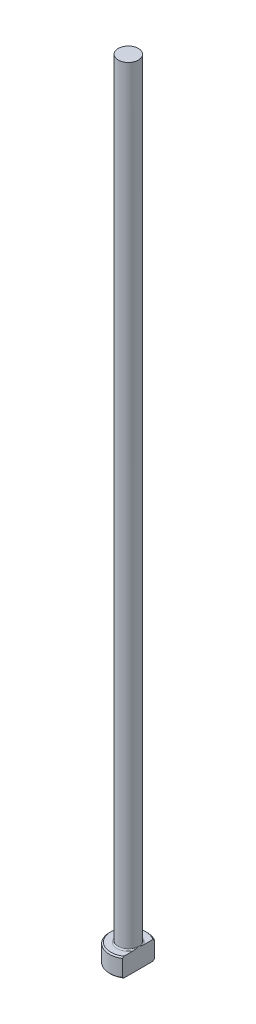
ISO-10303-21;
HEADER;
FILE_DESCRIPTION(('STEP AP214'),'2;1');
FILE_NAME('part.step','',(''),(''),'','','');
FILE_SCHEMA(('AUTOMOTIVE_DESIGN { 1 0 10303 214 1 1 1 1 }'));
ENDSEC;
DATA;
#1=APPLICATION_CONTEXT('core data for automotive mechanical design processes');
#2=APPLICATION_PROTOCOL_DEFINITION('international standard','automotive_design',2000,#1);
#3=PRODUCT_CONTEXT('',#1,'mechanical');
#4=PRODUCT('Part','Part','',(#3));
#5=PRODUCT_RELATED_PRODUCT_CATEGORY('part','',(#4));
#6=PRODUCT_DEFINITION_FORMATION('','',#4);
#7=PRODUCT_DEFINITION_CONTEXT('part definition',#1,'design');
#8=PRODUCT_DEFINITION('design','',#6,#7);
#9=PRODUCT_DEFINITION_SHAPE('','',#8);
#10=(LENGTH_UNIT() NAMED_UNIT(*) SI_UNIT(.MILLI.,.METRE.));
#11=(NAMED_UNIT(*) PLANE_ANGLE_UNIT() SI_UNIT($,.RADIAN.));
#12=(NAMED_UNIT(*) SI_UNIT($,.STERADIAN.) SOLID_ANGLE_UNIT());
#13=UNCERTAINTY_MEASURE_WITH_UNIT(LENGTH_MEASURE(1.E-05),#10,'distance_accuracy_value','');
#14=(GEOMETRIC_REPRESENTATION_CONTEXT(3) GLOBAL_UNCERTAINTY_ASSIGNED_CONTEXT((#13)) GLOBAL_UNIT_ASSIGNED_CONTEXT((#10,
#11,#12)) REPRESENTATION_CONTEXT('',''));
#15=CARTESIAN_POINT('',(0.,0.,0.));
#16=DIRECTION('',(0.,0.,1.));
#17=DIRECTION('',(1.,0.,0.));
#18=AXIS2_PLACEMENT_3D('',#15,#16,#17);
#19=CARTESIAN_POINT('',(0.,0.,0.));
#20=DIRECTION('',(0.,-1.,0.));
#21=DIRECTION('',(0.,0.,-1.));
#22=AXIS2_PLACEMENT_3D('',#19,#20,#21);
#23=PLANE('',#22);
#24=CARTESIAN_POINT('',(0.,0.,0.));
#25=DIRECTION('',(0.,-1.,0.));
#26=DIRECTION('',(0.,0.,-1.));
#27=AXIS2_PLACEMENT_3D('',#24,#25,#26);
#28=CIRCLE('',#27,2.79999999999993);
#29=CARTESIAN_POINT('',(1.59999999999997,0.,2.29782505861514));
#30=VERTEX_POINT('',#29);
#31=CARTESIAN_POINT('',(1.59999999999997,0.,-2.29782505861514));
#32=VERTEX_POINT('',#31);
#33=EDGE_CURVE('E98',#30,#32,#28,.T.);
#34=ORIENTED_EDGE('',*,*,#33,.T.);
#35=DIRECTION('',(0.,0.,1.));
#36=VECTOR('',#35,1.);
#37=CARTESIAN_POINT('',(1.59999999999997,0.,-2.53771550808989));
#38=LINE('',#37,#36);
#39=EDGE_CURVE('E83',#32,#30,#38,.T.);
#40=ORIENTED_EDGE('',*,*,#39,.T.);
#41=EDGE_LOOP('',(#34,#40));
#42=FACE_BOUND('',#41,.T.);
#43=ADVANCED_FACE('F32',(#42),#23,.T.);
#44=CARTESIAN_POINT('',(0.,259.958771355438,0.));
#45=DIRECTION('',(0.,1.,0.));
#46=DIRECTION('',(0.,0.,1.));
#47=AXIS2_PLACEMENT_3D('',#44,#45,#46);
#48=CYLINDRICAL_SURFACE('',#47,2.99999999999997);
#49=CARTESIAN_POINT('',(0.,2.80000000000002,0.));
#50=DIRECTION('',(0.,1.,0.));
#51=DIRECTION('',(0.,0.,1.));
#52=AXIS2_PLACEMENT_3D('',#49,#50,#51);
#53=CIRCLE('',#52,2.99999999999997);
#54=CARTESIAN_POINT('',(1.59999999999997,2.80000000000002,2.53771550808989));
#55=VERTEX_POINT('',#54);
#56=CARTESIAN_POINT('',(1.59999999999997,2.80000000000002,-2.53771550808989));
#57=VERTEX_POINT('',#56);
#58=EDGE_CURVE('E104',#55,#57,#53,.F.);
#59=ORIENTED_EDGE('',*,*,#58,.T.);
#60=DIRECTION('',(0.,-1.,0.));
#61=VECTOR('',#60,1.);
#62=CARTESIAN_POINT('',(1.59999999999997,125.,-2.53771550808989));
#63=LINE('',#62,#61);
#64=CARTESIAN_POINT('',(1.59999999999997,0.200000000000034,-2.53771550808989));
#65=VERTEX_POINT('',#64);
#66=EDGE_CURVE('E183',#57,#65,#63,.T.);
#67=ORIENTED_EDGE('',*,*,#66,.T.);
#68=CARTESIAN_POINT('',(0.,0.200000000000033,0.));
#69=DIRECTION('',(0.,-1.,0.));
#70=DIRECTION('',(0.,0.,-1.));
#71=AXIS2_PLACEMENT_3D('',#68,#69,#70);
#72=CIRCLE('',#71,2.99999999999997);
#73=CARTESIAN_POINT('',(1.59999999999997,0.200000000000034,2.53771550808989));
#74=VERTEX_POINT('',#73);
#75=EDGE_CURVE('E100',#65,#74,#72,.F.);
#76=ORIENTED_EDGE('',*,*,#75,.T.);
#77=DIRECTION('',(0.,-1.,0.));
#78=VECTOR('',#77,1.);
#79=CARTESIAN_POINT('',(1.59999999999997,125.,2.53771550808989));
#80=LINE('',#79,#78);
#81=EDGE_CURVE('E93',#55,#74,#80,.T.);
#82=ORIENTED_EDGE('',*,*,#81,.F.);
#83=EDGE_LOOP('',(#59,#67,#76,#82));
#84=FACE_BOUND('',#83,.T.);
#85=ADVANCED_FACE('F158',(#84),#48,.T.);
#86=CARTESIAN_POINT('',(-2.99999999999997,3.,0.));
#87=DIRECTION('',(0.,1.,0.));
#88=DIRECTION('',(0.,0.,1.));
#89=AXIS2_PLACEMENT_3D('',#86,#87,#88);
#90=PLANE('',#89);
#91=CARTESIAN_POINT('',(0.,3.,0.));
#92=DIRECTION('',(0.,1.,0.));
#93=DIRECTION('',(0.,0.,1.));
#94=AXIS2_PLACEMENT_3D('',#91,#92,#93);
#95=CIRCLE('',#94,2.79999999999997);
#96=CARTESIAN_POINT('',(1.59999999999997,3.,-2.2978250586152));
#97=VERTEX_POINT('',#96);
#98=CARTESIAN_POINT('',(1.59999999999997,3.,2.2978250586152));
#99=VERTEX_POINT('',#98);
#100=EDGE_CURVE('E178',#97,#99,#95,.T.);
#101=ORIENTED_EDGE('',*,*,#100,.T.);
#102=DIRECTION('',(0.,0.,-1.));
#103=VECTOR('',#102,1.);
#104=CARTESIAN_POINT('',(1.59999999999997,3.,0.));
#105=LINE('',#104,#103);
#106=CARTESIAN_POINT('',(1.59999999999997,2.99999999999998,0.824621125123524));
#107=VERTEX_POINT('',#106);
#108=EDGE_CURVE('E57',#99,#107,#105,.T.);
#109=ORIENTED_EDGE('',*,*,#108,.T.);
#110=CARTESIAN_POINT('',(0.,3.,0.));
#111=DIRECTION('',(0.,1.,0.));
#112=DIRECTION('',(0.,0.,1.));
#113=AXIS2_PLACEMENT_3D('',#110,#111,#112);
#114=CIRCLE('',#113,1.79999999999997);
#115=CARTESIAN_POINT('',(1.59999999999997,2.99999999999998,-0.824621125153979));
#116=VERTEX_POINT('',#115);
#117=EDGE_CURVE('E107',#107,#116,#114,.F.);
#118=ORIENTED_EDGE('',*,*,#117,.T.);
#119=EDGE_CURVE('E136',#116,#97,#105,.T.);
#120=ORIENTED_EDGE('',*,*,#119,.T.);
#121=EDGE_LOOP('',(#101,#109,#118,#120));
#122=FACE_BOUND('',#121,.T.);
#123=ADVANCED_FACE('F147',(#122),#90,.T.);
#124=CARTESIAN_POINT('',(0.,3.,0.));
#125=DIRECTION('',(0.,-1.,0.));
#126=DIRECTION('',(0.,0.,-1.));
#127=AXIS2_PLACEMENT_3D('',#124,#125,#126);
#128=CONICAL_SURFACE('',#127,2.79999999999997,0.7853981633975);
#129=ORIENTED_EDGE('',*,*,#58,.F.);
#130=CARTESIAN_POINT('',(1.59999999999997,-0.0101832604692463,5.58553753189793));
#131=CARTESIAN_POINT('',(1.59999999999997,0.0972362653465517,5.47379440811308));
#132=CARTESIAN_POINT('',(1.59999999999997,0.204532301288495,5.36193239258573));
#133=CARTESIAN_POINT('',(1.59999999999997,0.418819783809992,5.13791519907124));
#134=CARTESIAN_POINT('',(1.59999999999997,0.525811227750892,5.02576001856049));
#135=CARTESIAN_POINT('',(1.59999999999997,0.846303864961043,4.68870684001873));
#136=CARTESIAN_POINT('',(1.59999999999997,1.05925853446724,4.46328850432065));
#137=CARTESIAN_POINT('',(1.59999999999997,1.48118306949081,4.01229981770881));
#138=CARTESIAN_POINT('',(1.59999999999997,1.69017139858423,3.7867468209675));
#139=CARTESIAN_POINT('',(1.59999999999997,2.00096196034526,3.44598591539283));
#140=CARTESIAN_POINT('',(1.59999999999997,2.1041038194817,3.33200088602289));
#141=CARTESIAN_POINT('',(1.59999999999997,2.30919104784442,3.10296070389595));
#142=CARTESIAN_POINT('',(1.59999999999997,2.41113644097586,2.98790557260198));
#143=CARTESIAN_POINT('',(1.59999999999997,2.5875754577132,2.78593338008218));
#144=CARTESIAN_POINT('',(1.59999999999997,2.66243160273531,2.69933337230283));
#145=CARTESIAN_POINT('',(1.59999999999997,2.81098408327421,2.52513170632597));
#146=CARTESIAN_POINT('',(1.59999999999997,2.88468033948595,2.43752998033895));
#147=CARTESIAN_POINT('',(1.59999999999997,3.03092909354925,2.26058626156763));
#148=CARTESIAN_POINT('',(1.59999999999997,3.10347340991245,2.17123748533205));
#149=CARTESIAN_POINT('',(1.59999999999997,3.2464536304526,1.9908853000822));
#150=CARTESIAN_POINT('',(1.59999999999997,3.31688989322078,1.89988217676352));
#151=CARTESIAN_POINT('',(1.59999999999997,3.4554392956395,1.714866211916));
#152=CARTESIAN_POINT('',(1.59999999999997,3.52352676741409,1.62083402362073));
#153=CARTESIAN_POINT('',(1.59999999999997,3.65543930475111,1.42966446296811));
#154=CARTESIAN_POINT('',(1.59999999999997,3.71926060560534,1.33252445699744));
#155=CARTESIAN_POINT('',(1.59999999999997,3.8400582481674,1.1346812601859));
#156=CARTESIAN_POINT('',(1.59999999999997,3.89706669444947,1.03399793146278));
#157=CARTESIAN_POINT('',(1.59999999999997,4.00087857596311,0.827509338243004));
#158=CARTESIAN_POINT('',(1.59999999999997,4.04770238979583,0.721714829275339));
#159=CARTESIAN_POINT('',(1.59999999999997,4.10597629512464,0.558809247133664));
#160=CARTESIAN_POINT('',(1.59999999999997,4.12339902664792,0.5038462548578));
#161=CARTESIAN_POINT('',(1.59999999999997,4.15340775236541,0.392598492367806));
#162=CARTESIAN_POINT('',(1.59999999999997,4.16599453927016,0.336313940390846));
#163=CARTESIAN_POINT('',(1.59999999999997,4.18546795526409,0.223146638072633));
#164=CARTESIAN_POINT('',(1.59999999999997,4.19239315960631,0.166270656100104));
#165=CARTESIAN_POINT('',(1.59999999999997,4.20016451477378,0.0521012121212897));
#166=CARTESIAN_POINT('',(1.59999999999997,4.2010113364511,-0.00519220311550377));
#167=CARTESIAN_POINT('',(1.59999999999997,4.19655603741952,-0.1196065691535));
#168=CARTESIAN_POINT('',(1.59999999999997,4.19124611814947,-0.176727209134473));
#169=CARTESIAN_POINT('',(1.59999999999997,4.17487728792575,-0.29013232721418));
#170=CARTESIAN_POINT('',(1.59999999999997,4.16381718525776,-0.346416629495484));
#171=CARTESIAN_POINT('',(1.59999999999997,4.136581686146,-0.458175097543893));
#172=CARTESIAN_POINT('',(1.59999999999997,4.12036718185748,-0.513639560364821));
#173=CARTESIAN_POINT('',(1.59999999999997,4.08371568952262,-0.623133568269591));
#174=CARTESIAN_POINT('',(1.59999999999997,4.06327861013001,-0.677163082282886));
#175=CARTESIAN_POINT('',(1.59999999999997,4.01384079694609,-0.796206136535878));
#176=CARTESIAN_POINT('',(1.59999999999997,3.98395404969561,-0.860848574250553));
#177=CARTESIAN_POINT('',(1.59999999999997,3.92024875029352,-0.988182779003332));
#178=CARTESIAN_POINT('',(1.59999999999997,3.88642788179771,-1.050873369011));
#179=CARTESIAN_POINT('',(1.59999999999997,3.81575061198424,-1.17466308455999));
#180=CARTESIAN_POINT('',(1.59999999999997,3.77888858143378,-1.23575897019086));
#181=CARTESIAN_POINT('',(1.59999999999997,3.70287361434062,-1.35651466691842));
#182=CARTESIAN_POINT('',(1.59999999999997,3.66372022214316,-1.41617418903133));
#183=CARTESIAN_POINT('',(1.59999999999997,3.54280392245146,-1.5945818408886));
#184=CARTESIAN_POINT('',(1.59999999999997,3.45833719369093,-1.71149244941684));
#185=CARTESIAN_POINT('',(1.59999999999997,3.2850848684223,-1.94177313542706));
#186=CARTESIAN_POINT('',(1.59999999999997,3.19630496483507,-2.05514757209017));
#187=CARTESIAN_POINT('',(1.59999999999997,2.9813922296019,-2.32229937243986));
#188=CARTESIAN_POINT('',(1.59999999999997,2.85392433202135,-2.47499901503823));
#189=CARTESIAN_POINT('',(1.59999999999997,2.59557502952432,-2.77749164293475));
#190=CARTESIAN_POINT('',(1.59999999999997,2.46469312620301,-2.92728419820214));
#191=CARTESIAN_POINT('',(1.59999999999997,2.20054459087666,-3.22502658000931));
#192=CARTESIAN_POINT('',(1.59999999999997,2.06727561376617,-3.3729743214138));
#193=CARTESIAN_POINT('',(1.59999999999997,1.79919464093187,-3.66744344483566));
#194=CARTESIAN_POINT('',(1.59999999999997,1.66438274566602,-3.81396491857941));
#195=CARTESIAN_POINT('',(1.59999999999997,1.40205824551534,-4.09689102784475));
#196=CARTESIAN_POINT('',(1.59999999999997,1.27461301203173,-4.23335821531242));
#197=CARTESIAN_POINT('',(1.59999999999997,1.01897493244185,-4.50559511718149));
#198=CARTESIAN_POINT('',(1.59999999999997,0.890782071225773,-4.6413648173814));
#199=CARTESIAN_POINT('',(1.59999999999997,0.634049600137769,-4.91211710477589));
#200=CARTESIAN_POINT('',(1.59999999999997,0.50551101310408,-5.04710066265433));
#201=CARTESIAN_POINT('',(1.59999999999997,0.247978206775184,-5.31662434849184));
#202=CARTESIAN_POINT('',(1.59999999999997,0.118984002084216,-5.45116449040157));
#203=CARTESIAN_POINT('',(1.59999999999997,-0.0101832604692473,-5.58553753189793));
#204=B_SPLINE_CURVE_WITH_KNOTS('',3,(#130,#131,#132,#133,#134,#135,#136,#137,#138,#139,#140,
#141,#142,#143,#144,#145,#146,#147,#148,#149,#150,#151,#152,#153,#154,#155,#156,#157,#158,#159,
#160,#161,#162,#163,#164,#165,#166,#167,#168,#169,#170,#171,#172,#173,#174,#175,#176,#177,#178,
#179,#180,#181,#182,#183,#184,#185,#186,#187,#188,#189,#190,#191,#192,#193,#194,#195,#196,#197,
#198,#199,#200,#201,#202,#203),.UNSPECIFIED.,.F.,.F.,(4,2,2,2,2,2,2,2,2,2,2,2,2,2,2,2,2,2,2,2,2,
2,2,2,2,2,2,2,2,2,2,2,2,2,2,2,4),(0.,0.465004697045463,0.930013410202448,1.86031116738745,
2.78275396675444,3.24391793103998,3.70507266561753,4.04847005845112,4.39189082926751,
4.73714054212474,5.08233118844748,5.43053718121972,5.77904650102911,6.12584271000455,
6.47193849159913,6.64473721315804,6.81750759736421,6.98909076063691,7.16065498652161,
7.33243676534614,7.50425415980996,7.6774076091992,7.85056480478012,8.06403310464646,
8.27762773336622,8.49162700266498,8.70566897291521,9.13816403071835,9.57010297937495,
10.1667391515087,10.7634629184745,11.3608091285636,11.9581166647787,12.5182829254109,
13.0784605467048,13.6376414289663,14.1968045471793),.UNSPECIFIED.);
#205=EDGE_CURVE('E135',#55,#99,#204,.T.);
#206=ORIENTED_EDGE('',*,*,#205,.T.);
#207=ORIENTED_EDGE('',*,*,#100,.F.);
#208=EDGE_CURVE('E127',#97,#57,#204,.T.);
#209=ORIENTED_EDGE('',*,*,#208,.T.);
#210=EDGE_LOOP('',(#129,#206,#207,#209));
#211=FACE_BOUND('',#210,.T.);
#212=ADVANCED_FACE('F143',(#211),#128,.T.);
#213=CARTESIAN_POINT('',(0.,0.200000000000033,0.));
#214=DIRECTION('',(0.,1.,0.));
#215=DIRECTION('',(0.,0.,1.));
#216=AXIS2_PLACEMENT_3D('',#213,#214,#215);
#217=CONICAL_SURFACE('',#216,2.99999999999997,0.785398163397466);
#218=ORIENTED_EDGE('',*,*,#75,.F.);
#219=CARTESIAN_POINT('',(1.59999999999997,3.0101832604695,-5.58553753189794));
#220=CARTESIAN_POINT('',(1.59999999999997,2.90276373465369,-5.47379440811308));
#221=CARTESIAN_POINT('',(1.59999999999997,2.79546769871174,-5.36193239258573));
#222=CARTESIAN_POINT('',(1.59999999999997,2.58118021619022,-5.13791519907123));
#223=CARTESIAN_POINT('',(1.59999999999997,2.47418877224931,-5.02576001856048));
#224=CARTESIAN_POINT('',(1.59999999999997,2.15369613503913,-4.68870684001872));
#225=CARTESIAN_POINT('',(1.59999999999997,1.94074146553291,-4.46328850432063));
#226=CARTESIAN_POINT('',(1.59999999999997,1.5188169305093,-4.01229981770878));
#227=CARTESIAN_POINT('',(1.59999999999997,1.30982860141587,-3.78674682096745));
#228=CARTESIAN_POINT('',(1.59999999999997,0.9990380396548,-3.44598591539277));
#229=CARTESIAN_POINT('',(1.59999999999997,0.895896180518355,-3.33200088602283));
#230=CARTESIAN_POINT('',(1.59999999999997,0.690808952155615,-3.10296070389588));
#231=CARTESIAN_POINT('',(1.59999999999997,0.588863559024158,-2.98790557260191));
#232=CARTESIAN_POINT('',(1.59999999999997,0.412424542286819,-2.78593338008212));
#233=CARTESIAN_POINT('',(1.59999999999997,0.337568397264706,-2.69933337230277));
#234=CARTESIAN_POINT('',(1.59999999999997,0.189015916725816,-2.52513170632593));
#235=CARTESIAN_POINT('',(1.59999999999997,0.115319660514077,-2.43752998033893));
#236=CARTESIAN_POINT('',(1.59999999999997,-0.0309290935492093,-2.26058626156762));
#237=CARTESIAN_POINT('',(1.59999999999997,-0.103473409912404,-2.17123748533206));
#238=CARTESIAN_POINT('',(1.59999999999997,-0.246453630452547,-1.99088530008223));
#239=CARTESIAN_POINT('',(1.59999999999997,-0.316889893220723,-1.89988217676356));
#240=CARTESIAN_POINT('',(1.59999999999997,-0.455439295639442,-1.71486621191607));
#241=CARTESIAN_POINT('',(1.59999999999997,-0.523526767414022,-1.62083402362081));
#242=CARTESIAN_POINT('',(1.59999999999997,-0.655439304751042,-1.42966446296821));
#243=CARTESIAN_POINT('',(1.59999999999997,-0.719260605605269,-1.33252445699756));
#244=CARTESIAN_POINT('',(1.59999999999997,-0.840058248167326,-1.13468126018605));
#245=CARTESIAN_POINT('',(1.59999999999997,-0.897066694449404,-1.03399793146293));
#246=CARTESIAN_POINT('',(1.59999999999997,-1.00087857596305,-0.82750933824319));
#247=CARTESIAN_POINT('',(1.59999999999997,-1.04770238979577,-0.72171482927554));
#248=CARTESIAN_POINT('',(1.59999999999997,-1.1059762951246,-0.558809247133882));
#249=CARTESIAN_POINT('',(1.59999999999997,-1.12339902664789,-0.50384625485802));
#250=CARTESIAN_POINT('',(1.59999999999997,-1.15340775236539,-0.39259849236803));
#251=CARTESIAN_POINT('',(1.59999999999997,-1.16599453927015,-0.336313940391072));
#252=CARTESIAN_POINT('',(1.59999999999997,-1.18546795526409,-0.223146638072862));
#253=CARTESIAN_POINT('',(1.59999999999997,-1.19239315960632,-0.166270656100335));
#254=CARTESIAN_POINT('',(1.59999999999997,-1.20016451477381,-0.0521012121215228));
#255=CARTESIAN_POINT('',(1.59999999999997,-1.20101133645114,0.00519220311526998));
#256=CARTESIAN_POINT('',(1.59999999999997,-1.19655603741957,0.119606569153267));
#257=CARTESIAN_POINT('',(1.59999999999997,-1.19124611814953,0.176727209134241));
#258=CARTESIAN_POINT('',(1.59999999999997,-1.17487728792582,0.290132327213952));
#259=CARTESIAN_POINT('',(1.59999999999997,-1.16381718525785,0.346416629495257));
#260=CARTESIAN_POINT('',(1.59999999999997,-1.1365816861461,0.45817509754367));
#261=CARTESIAN_POINT('',(1.59999999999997,-1.12036718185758,0.5136395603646));
#262=CARTESIAN_POINT('',(1.59999999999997,-1.08371568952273,0.623133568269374));
#263=CARTESIAN_POINT('',(1.59999999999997,-1.06327861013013,0.677163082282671));
#264=CARTESIAN_POINT('',(1.59999999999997,-1.01384079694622,0.796206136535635));
#265=CARTESIAN_POINT('',(1.59999999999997,-0.983954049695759,0.860848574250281));
#266=CARTESIAN_POINT('',(1.59999999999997,-0.920248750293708,0.988182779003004));
#267=CARTESIAN_POINT('',(1.59999999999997,-0.886427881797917,1.05087336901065));
#268=CARTESIAN_POINT('',(1.59999999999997,-0.815750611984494,1.17466308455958));
#269=CARTESIAN_POINT('',(1.59999999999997,-0.778888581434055,1.23575897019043));
#270=CARTESIAN_POINT('',(1.59999999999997,-0.702873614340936,1.35651466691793));
#271=CARTESIAN_POINT('',(1.59999999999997,-0.663720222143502,1.41617418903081));
#272=CARTESIAN_POINT('',(1.59999999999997,-0.542803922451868,1.59458184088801));
#273=CARTESIAN_POINT('',(1.59999999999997,-0.458337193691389,1.7114924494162));
#274=CARTESIAN_POINT('',(1.59999999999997,-0.28508486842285,1.94177313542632));
#275=CARTESIAN_POINT('',(1.59999999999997,-0.196304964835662,2.05514757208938));
#276=CARTESIAN_POINT('',(1.59999999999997,0.0186077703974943,2.32229937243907));
#277=CARTESIAN_POINT('',(1.59999999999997,0.146075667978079,2.47499901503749));
#278=CARTESIAN_POINT('',(1.59999999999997,0.404424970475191,2.7774916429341));
#279=CARTESIAN_POINT('',(1.59999999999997,0.535306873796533,2.92728419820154));
#280=CARTESIAN_POINT('',(1.59999999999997,0.799455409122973,3.22502658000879));
#281=CARTESIAN_POINT('',(1.59999999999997,0.932724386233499,3.37297432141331));
#282=CARTESIAN_POINT('',(1.59999999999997,1.20080535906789,3.66744344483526));
#283=CARTESIAN_POINT('',(1.59999999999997,1.33561725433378,3.81396491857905));
#284=CARTESIAN_POINT('',(1.59999999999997,1.59794175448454,4.09689102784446));
#285=CARTESIAN_POINT('',(1.59999999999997,1.72538698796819,4.23335821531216));
#286=CARTESIAN_POINT('',(1.59999999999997,1.98102506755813,4.50559511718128));
#287=CARTESIAN_POINT('',(1.59999999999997,2.10921792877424,4.64136481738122));
#288=CARTESIAN_POINT('',(1.59999999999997,2.36595039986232,4.91211710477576));
#289=CARTESIAN_POINT('',(1.59999999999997,2.49448898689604,5.04710066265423));
#290=CARTESIAN_POINT('',(1.59999999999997,2.752021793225,5.31662434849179));
#291=CARTESIAN_POINT('',(1.59999999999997,2.881015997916,5.45116449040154));
#292=CARTESIAN_POINT('',(1.59999999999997,3.0101832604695,5.58553753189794));
#293=B_SPLINE_CURVE_WITH_KNOTS('',3,(#219,#220,#221,#222,#223,#224,#225,#226,#227,#228,#229,
#230,#231,#232,#233,#234,#235,#236,#237,#238,#239,#240,#241,#242,#243,#244,#245,#246,#247,#248,
#249,#250,#251,#252,#253,#254,#255,#256,#257,#258,#259,#260,#261,#262,#263,#264,#265,#266,#267,
#268,#269,#270,#271,#272,#273,#274,#275,#276,#277,#278,#279,#280,#281,#282,#283,#284,#285,#286,
#287,#288,#289,#290,#291,#292),.UNSPECIFIED.,.F.,.F.,(4,2,2,2,2,2,2,2,2,2,2,2,2,2,2,2,2,2,2,2,2,
2,2,2,2,2,2,2,2,2,2,2,2,2,2,2,4),(0.,0.46500469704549,0.9300134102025,1.86031116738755,
2.7827539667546,3.24391793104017,3.70507266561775,4.04847005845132,4.39189082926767,
4.73714054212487,5.08233118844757,5.43053718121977,5.77904650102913,6.12584271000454,
6.47193849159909,6.644737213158,6.81750759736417,6.98909076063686,7.16065498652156,
7.3324367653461,7.50425415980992,7.67740760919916,7.85056480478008,8.06403310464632,
8.27762773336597,8.49162700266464,8.70566897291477,9.1381640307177,9.57010297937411,
10.166739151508,10.763462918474,11.3608091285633,11.9581166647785,12.5182829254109,
13.0784605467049,13.6376414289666,14.1968045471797),.UNSPECIFIED.);
#294=EDGE_CURVE('E86',#65,#32,#293,.T.);
#295=ORIENTED_EDGE('',*,*,#294,.T.);
#296=ORIENTED_EDGE('',*,*,#33,.F.);
#297=EDGE_CURVE('E89',#30,#74,#293,.T.);
#298=ORIENTED_EDGE('',*,*,#297,.T.);
#299=EDGE_LOOP('',(#218,#295,#296,#298));
#300=FACE_BOUND('',#299,.T.);
#301=ADVANCED_FACE('F97',(#300),#217,.T.);
#302=CARTESIAN_POINT('',(0.,3.19999999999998,0.));
#303=DIRECTION('',(0.,1.,0.));
#304=DIRECTION('',(0.,0.,1.));
#305=AXIS2_PLACEMENT_3D('',#302,#303,#304);
#306=TOROIDAL_SURFACE('',#305,1.79999999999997,0.2);
#307=CARTESIAN_POINT('',(1.59999999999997,3.19999999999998,0.));
#308=CARTESIAN_POINT('',(1.59999999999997,3.20000050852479,4.54943754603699E-11));
#309=CARTESIAN_POINT('',(1.59999999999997,3.20000101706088,-1.26961255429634E-07));
#310=CARTESIAN_POINT('',(1.59999999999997,3.20000198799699,-5.15663776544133E-07));
#311=CARTESIAN_POINT('',(1.59999999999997,3.20000244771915,-7.82570768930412E-07));
#312=CARTESIAN_POINT('',(1.59999999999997,3.20000337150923,-1.42107859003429E-06));
#313=CARTESIAN_POINT('',(1.59999999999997,3.2000038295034,-1.8013897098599E-06));
#314=CARTESIAN_POINT('',(1.59999999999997,3.20000468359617,-2.61302269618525E-06));
#315=CARTESIAN_POINT('',(1.59999999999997,3.20000508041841,-3.04362154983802E-06));
#316=CARTESIAN_POINT('',(1.59999999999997,3.20000644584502,-4.61783099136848E-06));
#317=CARTESIAN_POINT('',(1.59999999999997,3.2000073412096,-5.82629496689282E-06));
#318=CARTESIAN_POINT('',(1.59999999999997,3.20000890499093,-8.29532278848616E-06));
#319=CARTESIAN_POINT('',(1.59999999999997,3.2000095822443,-9.55059430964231E-06));
#320=CARTESIAN_POINT('',(1.59999999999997,3.2000122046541,-1.4561779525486E-05));
#321=CARTESIAN_POINT('',(1.59999999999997,3.20001402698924,-1.8385925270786E-05));
#322=CARTESIAN_POINT('',(1.59999999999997,3.20001693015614,-2.58398167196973E-05));
#323=CARTESIAN_POINT('',(1.59999999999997,3.20001806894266,-2.9447492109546E-05));
#324=CARTESIAN_POINT('',(1.59999999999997,3.20002303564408,-4.5117550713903E-05));
#325=CARTESIAN_POINT('',(1.59999999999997,3.20002690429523,-5.71577768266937E-05));
#326=CARTESIAN_POINT('',(1.59999999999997,3.20003298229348,-7.95113108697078E-05));
#327=CARTESIAN_POINT('',(1.59999999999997,3.20003536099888,-8.97762976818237E-05));
#328=CARTESIAN_POINT('',(1.59999999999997,3.20005453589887,-0.000165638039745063));
#329=CARTESIAN_POINT('',(1.59999999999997,3.20007944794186,-0.000228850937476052));
#330=CARTESIAN_POINT('',(1.59999999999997,3.20017354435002,-0.000476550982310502));
#331=CARTESIAN_POINT('',(1.59999999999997,3.20023667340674,-0.000662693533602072));
#332=CARTESIAN_POINT('',(1.59999999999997,3.2004875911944,-0.00139193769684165));
#333=CARTESIAN_POINT('',(1.59999999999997,3.20068172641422,-0.00193335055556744));
#334=CARTESIAN_POINT('',(1.59999999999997,3.20147743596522,-0.00416279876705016));
#335=CARTESIAN_POINT('',(1.59999999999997,3.20207183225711,-0.00585269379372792));
#336=CARTESIAN_POINT('',(1.59999999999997,3.2087643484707,-0.0248666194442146));
#337=CARTESIAN_POINT('',(1.59999999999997,3.21490191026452,-0.0421807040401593));
#338=CARTESIAN_POINT('',(1.59999999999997,3.22687857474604,-0.0761752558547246));
#339=CARTESIAN_POINT('',(1.59999999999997,3.23272018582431,-0.092854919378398));
#340=CARTESIAN_POINT('',(1.59999999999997,3.2450295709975,-0.128242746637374));
#341=CARTESIAN_POINT('',(1.59999999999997,3.25148835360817,-0.146954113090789));
#342=CARTESIAN_POINT('',(1.59999999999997,3.26432449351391,-0.18462192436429));
#343=CARTESIAN_POINT('',(1.59999999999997,3.27070030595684,-0.203578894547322));
#344=CARTESIAN_POINT('',(1.59999999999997,3.2861130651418,-0.250227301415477));
#345=CARTESIAN_POINT('',(1.59999999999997,3.29503653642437,-0.277956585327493));
#346=CARTESIAN_POINT('',(1.59999999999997,3.31206503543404,-0.332930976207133));
#347=CARTESIAN_POINT('',(1.59999999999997,3.32018465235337,-0.360171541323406));
#348=CARTESIAN_POINT('',(1.59999999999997,3.33730366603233,-0.420681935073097));
#349=CARTESIAN_POINT('',(1.59999999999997,3.34612355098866,-0.454003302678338));
#350=CARTESIAN_POINT('',(1.59999999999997,3.36232017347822,-0.521270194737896));
#351=CARTESIAN_POINT('',(1.59999999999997,3.36968538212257,-0.555218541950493));
#352=CARTESIAN_POINT('',(1.59999999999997,3.38286655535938,-0.625950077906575));
#353=CARTESIAN_POINT('',(1.59999999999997,3.3885334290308,-0.6627618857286));
#354=CARTESIAN_POINT('',(1.59999999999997,3.3967820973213,-0.736647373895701));
#355=CARTESIAN_POINT('',(1.59999999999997,3.39937308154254,-0.773719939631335));
#356=CARTESIAN_POINT('',(1.59999999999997,3.40041949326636,-0.847207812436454));
#357=CARTESIAN_POINT('',(1.59999999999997,3.39895641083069,-0.88362147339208));
#358=CARTESIAN_POINT('',(1.59999999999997,3.39061157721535,-0.955314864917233));
#359=CARTESIAN_POINT('',(1.59999999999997,3.3838299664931,-0.990603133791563));
#360=CARTESIAN_POINT('',(1.59999999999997,3.36933665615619,-1.03710764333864));
#361=CARTESIAN_POINT('',(1.59999999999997,3.36495855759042,-1.04936206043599));
#362=CARTESIAN_POINT('',(1.59999999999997,3.35498242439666,-1.07342013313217));
#363=CARTESIAN_POINT('',(1.59999999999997,3.34938064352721,-1.08522227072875));
#364=CARTESIAN_POINT('',(1.59999999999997,3.33671785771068,-1.10815425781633));
#365=CARTESIAN_POINT('',(1.59999999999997,3.32964542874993,-1.11927790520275));
#366=CARTESIAN_POINT('',(1.59999999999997,3.31385032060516,-1.14028316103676));
#367=CARTESIAN_POINT('',(1.59999999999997,3.30513251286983,-1.15016829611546));
#368=CARTESIAN_POINT('',(1.59999999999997,3.2893714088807,-1.16476986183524));
#369=CARTESIAN_POINT('',(1.59999999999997,3.28286385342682,-1.17006219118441));
#370=CARTESIAN_POINT('',(1.59999999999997,3.26911414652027,-1.179603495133));
#371=CARTESIAN_POINT('',(1.59999999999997,3.2618722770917,-1.18385286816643));
#372=CARTESIAN_POINT('',(1.59999999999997,3.24665711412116,-1.19105502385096));
#373=CARTESIAN_POINT('',(1.59999999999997,3.23867649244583,-1.19399264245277));
#374=CARTESIAN_POINT('',(1.59999999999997,3.22228884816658,-1.19821047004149));
#375=CARTESIAN_POINT('',(1.59999999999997,3.21388246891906,-1.19949310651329));
#376=CARTESIAN_POINT('',(1.59999999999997,3.19822871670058,-1.20020429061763));
#377=CARTESIAN_POINT('',(1.59999999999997,3.19099166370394,-1.19987658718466));
#378=CARTESIAN_POINT('',(1.59999999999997,3.1766911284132,-1.19794337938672));
#379=CARTESIAN_POINT('',(1.59999999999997,3.16962767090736,-1.19633769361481));
#380=CARTESIAN_POINT('',(1.59999999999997,3.15619326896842,-1.19208069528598));
#381=CARTESIAN_POINT('',(1.59999999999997,3.14980538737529,-1.18948176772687));
#382=CARTESIAN_POINT('',(1.59999999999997,3.13747056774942,-1.18339991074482));
#383=CARTESIAN_POINT('',(1.59999999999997,3.13152374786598,-1.17991674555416));
#384=CARTESIAN_POINT('',(1.59999999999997,3.11701630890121,-1.17013377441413));
#385=CARTESIAN_POINT('',(1.59999999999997,3.10879365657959,-1.16333250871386));
#386=CARTESIAN_POINT('',(1.59999999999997,3.09352344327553,-1.14851362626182));
#387=CARTESIAN_POINT('',(1.59999999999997,3.08647946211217,-1.14049244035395));
#388=CARTESIAN_POINT('',(1.59999999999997,3.06978612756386,-1.11881325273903));
#389=CARTESIAN_POINT('',(1.59999999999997,3.06093454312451,-1.10454463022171));
#390=CARTESIAN_POINT('',(1.59999999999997,3.045486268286,-1.07488732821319));
#391=CARTESIAN_POINT('',(1.59999999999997,3.03889016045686,-1.05949836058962));
#392=CARTESIAN_POINT('',(1.59999999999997,3.02310414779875,-1.01585357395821));
#393=CARTESIAN_POINT('',(1.59999999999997,3.01588276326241,-0.98689334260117));
#394=CARTESIAN_POINT('',(1.59999999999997,3.00554634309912,-0.927965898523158));
#395=CARTESIAN_POINT('',(1.59999999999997,3.00248580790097,-0.89799049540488));
#396=CARTESIAN_POINT('',(1.59999999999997,2.99950013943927,-0.836442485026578));
#397=CARTESIAN_POINT('',(1.59999999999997,2.99973474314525,-0.804863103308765));
#398=CARTESIAN_POINT('',(1.59999999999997,3.00289974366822,-0.74177978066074));
#399=CARTESIAN_POINT('',(1.59999999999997,3.00583724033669,-0.710276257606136));
#400=CARTESIAN_POINT('',(1.59999999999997,3.01360294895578,-0.649223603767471));
#401=CARTESIAN_POINT('',(1.59999999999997,3.01832173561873,-0.61965999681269));
#402=CARTESIAN_POINT('',(1.59999999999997,3.02922114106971,-0.561003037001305));
#403=CARTESIAN_POINT('',(1.59999999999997,3.03539231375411,-0.531907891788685));
#404=CARTESIAN_POINT('',(1.59999999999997,3.05057454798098,-0.466833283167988));
#405=CARTESIAN_POINT('',(1.59999999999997,3.05991050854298,-0.430930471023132));
#406=CARTESIAN_POINT('',(1.59999999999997,3.08015300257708,-0.358646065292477));
#407=CARTESIAN_POINT('',(1.59999999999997,3.09109187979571,-0.322273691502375));
#408=CARTESIAN_POINT('',(1.59999999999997,3.11028869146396,-0.261379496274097));
#409=CARTESIAN_POINT('',(1.59999999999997,3.1182898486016,-0.236775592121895));
#410=CARTESIAN_POINT('',(1.59999999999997,3.13453271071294,-0.18793162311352));
#411=CARTESIAN_POINT('',(1.59999999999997,3.14277104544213,-0.163690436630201));
#412=CARTESIAN_POINT('',(1.59999999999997,3.158545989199,-0.117881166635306));
#413=CARTESIAN_POINT('',(1.59999999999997,3.16606272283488,-0.0963061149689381));
#414=CARTESIAN_POINT('',(1.59999999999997,3.18151152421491,-0.0523381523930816));
#415=CARTESIAN_POINT('',(1.59999999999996,3.18944823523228,-0.0299467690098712));
#416=CARTESIAN_POINT('',(1.59999999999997,3.19792848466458,-0.0058516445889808));
#417=CARTESIAN_POINT('',(1.59999999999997,3.19852328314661,-0.00416072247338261));
#418=CARTESIAN_POINT('',(1.59999999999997,3.19931909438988,-0.00193103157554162));
#419=CARTESIAN_POINT('',(1.59999999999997,3.19951294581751,-0.00139040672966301));
#420=CARTESIAN_POINT('',(1.59999999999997,3.19976352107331,-0.000662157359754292));
#421=CARTESIAN_POINT('',(1.59999999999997,3.19982658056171,-0.000476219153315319));
#422=CARTESIAN_POINT('',(1.59999999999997,3.19992058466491,-0.000228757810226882));
#423=CARTESIAN_POINT('',(1.59999999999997,3.19994548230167,-0.000165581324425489));
#424=CARTESIAN_POINT('',(1.59999999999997,3.19996464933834,-8.97604211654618E-05));
#425=CARTESIAN_POINT('',(1.59999999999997,3.19996702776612,-7.94979693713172E-05));
#426=CARTESIAN_POINT('',(1.59999999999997,3.19997310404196,-5.71501112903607E-05));
#427=CARTESIAN_POINT('',(1.59999999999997,3.19997697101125,-4.51129589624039E-05));
#428=CARTESIAN_POINT('',(1.59999999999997,3.19998193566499,-2.94463390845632E-05));
#429=CARTESIAN_POINT('',(1.59999999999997,3.19998307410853,-2.58390376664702E-05));
#430=CARTESIAN_POINT('',(1.59999999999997,3.1999859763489,-1.83858674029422E-05));
#431=CARTESIAN_POINT('',(1.59999999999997,3.19998779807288,-1.45620535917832E-05));
#432=CARTESIAN_POINT('',(1.59999999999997,3.19999041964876,-9.55118975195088E-06));
#433=CARTESIAN_POINT('',(1.59999999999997,3.19999109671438,-8.29594696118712E-06));
#434=CARTESIAN_POINT('',(1.59999999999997,3.19999266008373,-5.82694057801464E-06));
#435=CARTESIAN_POINT('',(1.59999999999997,3.19999355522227,-4.61846686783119E-06));
#436=CARTESIAN_POINT('',(1.59999999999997,3.19999492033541,-3.04420143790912E-06));
#437=CARTESIAN_POINT('',(1.59999999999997,3.19999531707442,-2.61357770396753E-06));
#438=CARTESIAN_POINT('',(1.59999999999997,3.19999617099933,-1.80187998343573E-06));
#439=CARTESIAN_POINT('',(1.59999999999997,3.19999662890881,-1.4215287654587E-06));
#440=CARTESIAN_POINT('',(1.59999999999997,3.19999755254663,-7.8292447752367E-07));
#441=CARTESIAN_POINT('',(1.59999999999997,3.199998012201,-5.1596356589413E-07));
#442=CARTESIAN_POINT('',(1.59999999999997,3.19999898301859,-1.27129000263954E-07));
#443=CARTESIAN_POINT('',(1.59999999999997,3.19999949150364,-4.54918281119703E-11));
#444=CARTESIAN_POINT('',(1.59999999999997,3.19999999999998,0.));
#445=B_SPLINE_CURVE_WITH_KNOTS('',3,(#307,#308,#309,#310,#311,#312,#313,#314,#315,#316,#317,
#318,#319,#320,#321,#322,#323,#324,#325,#326,#327,#328,#329,#330,#331,#332,#333,#334,#335,#336,
#337,#338,#339,#340,#341,#342,#343,#344,#345,#346,#347,#348,#349,#350,#351,#352,#353,#354,#355,
#356,#357,#358,#359,#360,#361,#362,#363,#364,#365,#366,#367,#368,#369,#370,#371,#372,#373,#374,
#375,#376,#377,#378,#379,#380,#381,#382,#383,#384,#385,#386,#387,#388,#389,#390,#391,#392,#393,
#394,#395,#396,#397,#398,#399,#400,#401,#402,#403,#404,#405,#406,#407,#408,#409,#410,#411,#412,
#413,#414,#415,#416,#417,#418,#419,#420,#421,#422,#423,#424,#425,#426,#427,#428,#429,#430,#431,
#432,#433,#434,#435,#436,#437,#438,#439,#440,#441,#442,#443,#444),.UNSPECIFIED.,.T.,.F.,(4,2,2,
2,2,2,2,2,2,2,2,2,2,2,2,2,2,2,2,2,2,2,2,2,2,2,2,2,2,2,2,2,2,2,2,2,2,2,2,2,2,2,2,2,2,2,2,2,2,2,2,
2,2,2,2,2,2,2,2,2,2,2,2,2,2,2,2,2,4),(0.,1.52634300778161E-06,3.11406916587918E-06,
4.89195151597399E-06,6.64684989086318E-06,1.11381074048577E-05,1.54135914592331E-05,
2.80880177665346E-05,3.94249647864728E-05,7.7360103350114E-05,0.000108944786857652,
0.000312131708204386,0.00090234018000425,0.00262715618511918,0.00800204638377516,
0.0631063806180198,0.116126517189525,0.175509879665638,0.235510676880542,0.322894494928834,
0.408161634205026,0.511541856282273,0.615711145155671,0.727355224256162,0.838664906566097,
0.947753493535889,1.05483601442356,1.09382604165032,1.13293715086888,1.17236425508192,
1.21167640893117,1.23676182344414,1.26183763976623,1.28719627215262,1.31251766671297,
1.33413541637,1.35575623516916,1.37636641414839,1.39698209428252,1.42881268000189,
1.46073825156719,1.51082746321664,1.56092960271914,1.64997182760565,1.74016947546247,
1.83475408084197,1.92958784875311,2.01935385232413,2.10855142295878,2.21980473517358,
2.33373085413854,2.4113451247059,2.48815160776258,2.55669374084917,2.62795640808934,
2.63333459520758,2.63505690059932,2.63564646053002,2.63584953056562,2.63588110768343,
2.6359190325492,2.63593036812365,2.63594304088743,2.63594731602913,2.63595180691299,
2.63595356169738,2.63595533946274,2.63595692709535,2.63595845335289),.UNSPECIFIED.);
#446=CARTESIAN_POINT('',(1.59999999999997,3.19999999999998,0.));
#447=VERTEX_POINT('',#446);
#448=EDGE_CURVE('E11',#116,#447,#445,.T.);
#449=ORIENTED_EDGE('',*,*,#448,.F.);
#450=ORIENTED_EDGE('',*,*,#117,.F.);
#451=CARTESIAN_POINT('',(1.59999999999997,3.19999999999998,0.));
#452=CARTESIAN_POINT('',(1.59999999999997,3.19999949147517,-4.54943940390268E-11));
#453=CARTESIAN_POINT('',(1.59999999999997,3.19999898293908,1.26961255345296E-07));
#454=CARTESIAN_POINT('',(1.59999999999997,3.19999801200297,5.1566377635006E-07));
#455=CARTESIAN_POINT('',(1.59999999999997,3.19999755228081,7.82570768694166E-07));
#456=CARTESIAN_POINT('',(1.59999999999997,3.19999662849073,1.4210785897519E-06));
#457=CARTESIAN_POINT('',(1.59999999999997,3.19999617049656,1.80138970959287E-06));
#458=CARTESIAN_POINT('',(1.59999999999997,3.19999531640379,2.61302269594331E-06));
#459=CARTESIAN_POINT('',(1.59999999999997,3.19999491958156,3.04362154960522E-06));
#460=CARTESIAN_POINT('',(1.59999999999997,3.19999355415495,4.61783099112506E-06));
#461=CARTESIAN_POINT('',(1.59999999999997,3.19999265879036,5.82629496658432E-06));
#462=CARTESIAN_POINT('',(1.59999999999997,3.19999109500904,8.29532278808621E-06));
#463=CARTESIAN_POINT('',(1.59999999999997,3.19999041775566,9.55059430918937E-06));
#464=CARTESIAN_POINT('',(1.59999999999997,3.19998779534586,1.45617795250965E-05));
#465=CARTESIAN_POINT('',(1.59999999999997,3.19998597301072,1.83859252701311E-05));
#466=CARTESIAN_POINT('',(1.59999999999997,3.19998306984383,2.58398167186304E-05));
#467=CARTESIAN_POINT('',(1.59999999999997,3.1999819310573,2.94474921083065E-05));
#468=CARTESIAN_POINT('',(1.59999999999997,3.19997696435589,4.51175507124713E-05));
#469=CARTESIAN_POINT('',(1.59999999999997,3.19997309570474,5.7157776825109E-05));
#470=CARTESIAN_POINT('',(1.59999999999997,3.19996701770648,7.95113108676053E-05));
#471=CARTESIAN_POINT('',(1.59999999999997,3.19996463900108,8.9776297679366E-05));
#472=CARTESIAN_POINT('',(1.59999999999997,3.19994546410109,0.000165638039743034));
#473=CARTESIAN_POINT('',(1.59999999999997,3.1999205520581,0.000228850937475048));
#474=CARTESIAN_POINT('',(1.59999999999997,3.19982645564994,0.000476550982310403));
#475=CARTESIAN_POINT('',(1.59999999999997,3.19976332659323,0.000662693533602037));
#476=CARTESIAN_POINT('',(1.59999999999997,3.19951240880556,0.0013919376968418));
#477=CARTESIAN_POINT('',(1.59999999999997,3.19931827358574,0.0019333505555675));
#478=CARTESIAN_POINT('',(1.59999999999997,3.19852256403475,0.00416279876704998));
#479=CARTESIAN_POINT('',(1.59999999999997,3.19792816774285,0.00585269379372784));
#480=CARTESIAN_POINT('',(1.59999999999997,3.19123565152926,0.0248666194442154));
#481=CARTESIAN_POINT('',(1.59999999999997,3.18509808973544,0.0421807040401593));
#482=CARTESIAN_POINT('',(1.59999999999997,3.17312142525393,0.0761752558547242));
#483=CARTESIAN_POINT('',(1.59999999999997,3.16727981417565,0.0928549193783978));
#484=CARTESIAN_POINT('',(1.59999999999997,3.15497042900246,0.128242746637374));
#485=CARTESIAN_POINT('',(1.59999999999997,3.14851164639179,0.146954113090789));
#486=CARTESIAN_POINT('',(1.59999999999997,3.13567550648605,0.18462192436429));
#487=CARTESIAN_POINT('',(1.59999999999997,3.12929969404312,0.203578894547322));
#488=CARTESIAN_POINT('',(1.59999999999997,3.11388693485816,0.250227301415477));
#489=CARTESIAN_POINT('',(1.59999999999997,3.10496346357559,0.277956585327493));
#490=CARTESIAN_POINT('',(1.59999999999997,3.08793496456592,0.332930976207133));
#491=CARTESIAN_POINT('',(1.59999999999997,3.0798153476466,0.360171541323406));
#492=CARTESIAN_POINT('',(1.59999999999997,3.06269633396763,0.420681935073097));
#493=CARTESIAN_POINT('',(1.59999999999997,3.0538764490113,0.454003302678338));
#494=CARTESIAN_POINT('',(1.59999999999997,3.03767982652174,0.521270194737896));
#495=CARTESIAN_POINT('',(1.59999999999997,3.03031461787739,0.555218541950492));
#496=CARTESIAN_POINT('',(1.59999999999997,3.01713344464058,0.625950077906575));
#497=CARTESIAN_POINT('',(1.59999999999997,3.01146657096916,0.6627618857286));
#498=CARTESIAN_POINT('',(1.59999999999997,3.00321790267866,0.736647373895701));
#499=CARTESIAN_POINT('',(1.59999999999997,3.00062691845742,0.773719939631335));
#500=CARTESIAN_POINT('',(1.59999999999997,2.9995805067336,0.847207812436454));
#501=CARTESIAN_POINT('',(1.59999999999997,3.00104358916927,0.88362147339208));
#502=CARTESIAN_POINT('',(1.59999999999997,3.00938842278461,0.955314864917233));
#503=CARTESIAN_POINT('',(1.59999999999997,3.01617003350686,0.990603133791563));
#504=CARTESIAN_POINT('',(1.59999999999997,3.03066334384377,1.03710764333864));
#505=CARTESIAN_POINT('',(1.59999999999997,3.03504144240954,1.04936206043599));
#506=CARTESIAN_POINT('',(1.59999999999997,3.04501757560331,1.07342013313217));
#507=CARTESIAN_POINT('',(1.59999999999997,3.05061935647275,1.08522227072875));
#508=CARTESIAN_POINT('',(1.59999999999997,3.06328214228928,1.10815425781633));
#509=CARTESIAN_POINT('',(1.59999999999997,3.07035457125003,1.11927790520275));
#510=CARTESIAN_POINT('',(1.59999999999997,3.0861496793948,1.14028316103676));
#511=CARTESIAN_POINT('',(1.59999999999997,3.09486748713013,1.15016829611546));
#512=CARTESIAN_POINT('',(1.59999999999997,3.11062859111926,1.16476986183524));
#513=CARTESIAN_POINT('',(1.59999999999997,3.11713614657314,1.17006219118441));
#514=CARTESIAN_POINT('',(1.59999999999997,3.13088585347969,1.179603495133));
#515=CARTESIAN_POINT('',(1.59999999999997,3.13812772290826,1.18385286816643));
#516=CARTESIAN_POINT('',(1.59999999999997,3.1533428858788,1.19105502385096));
#517=CARTESIAN_POINT('',(1.59999999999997,3.16132350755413,1.19399264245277));
#518=CARTESIAN_POINT('',(1.59999999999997,3.17771115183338,1.19821047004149));
#519=CARTESIAN_POINT('',(1.59999999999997,3.1861175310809,1.19949310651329));
#520=CARTESIAN_POINT('',(1.59999999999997,3.20177128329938,1.20020429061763));
#521=CARTESIAN_POINT('',(1.59999999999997,3.20900833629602,1.19987658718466));
#522=CARTESIAN_POINT('',(1.59999999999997,3.22330887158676,1.19794337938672));
#523=CARTESIAN_POINT('',(1.59999999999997,3.2303723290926,1.19633769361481));
#524=CARTESIAN_POINT('',(1.59999999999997,3.24380673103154,1.19208069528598));
#525=CARTESIAN_POINT('',(1.59999999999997,3.25019461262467,1.18948176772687));
#526=CARTESIAN_POINT('',(1.59999999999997,3.26252943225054,1.18339991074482));
#527=CARTESIAN_POINT('',(1.59999999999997,3.26847625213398,1.17991674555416));
#528=CARTESIAN_POINT('',(1.59999999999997,3.28298369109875,1.17013377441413));
#529=CARTESIAN_POINT('',(1.59999999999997,3.29120634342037,1.16333250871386));
#530=CARTESIAN_POINT('',(1.59999999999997,3.30647655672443,1.14851362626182));
#531=CARTESIAN_POINT('',(1.59999999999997,3.31352053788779,1.14049244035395));
#532=CARTESIAN_POINT('',(1.59999999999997,3.3302138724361,1.11881325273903));
#533=CARTESIAN_POINT('',(1.59999999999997,3.33906545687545,1.10454463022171));
#534=CARTESIAN_POINT('',(1.59999999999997,3.35451373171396,1.07488732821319));
#535=CARTESIAN_POINT('',(1.59999999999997,3.36110983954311,1.05949836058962));
#536=CARTESIAN_POINT('',(1.59999999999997,3.37689585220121,1.01585357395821));
#537=CARTESIAN_POINT('',(1.59999999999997,3.38411723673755,0.98689334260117));
#538=CARTESIAN_POINT('',(1.59999999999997,3.39445365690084,0.927965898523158));
#539=CARTESIAN_POINT('',(1.59999999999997,3.397514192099,0.89799049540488));
#540=CARTESIAN_POINT('',(1.59999999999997,3.40049986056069,0.836442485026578));
#541=CARTESIAN_POINT('',(1.59999999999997,3.40026525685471,0.804863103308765));
#542=CARTESIAN_POINT('',(1.59999999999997,3.39710025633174,0.74177978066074));
#543=CARTESIAN_POINT('',(1.59999999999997,3.39416275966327,0.710276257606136));
#544=CARTESIAN_POINT('',(1.59999999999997,3.38639705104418,0.649223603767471));
#545=CARTESIAN_POINT('',(1.59999999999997,3.38167826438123,0.61965999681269));
#546=CARTESIAN_POINT('',(1.59999999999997,3.37077885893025,0.561003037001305));
#547=CARTESIAN_POINT('',(1.59999999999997,3.36460768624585,0.531907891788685));
#548=CARTESIAN_POINT('',(1.59999999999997,3.34942545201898,0.466833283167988));
#549=CARTESIAN_POINT('',(1.59999999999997,3.34008949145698,0.430930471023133));
#550=CARTESIAN_POINT('',(1.59999999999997,3.31984699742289,0.358646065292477));
#551=CARTESIAN_POINT('',(1.59999999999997,3.30890812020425,0.322273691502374));
#552=CARTESIAN_POINT('',(1.59999999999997,3.289711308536,0.261379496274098));
#553=CARTESIAN_POINT('',(1.59999999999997,3.28171015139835,0.236775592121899));
#554=CARTESIAN_POINT('',(1.59999999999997,3.26546728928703,0.187931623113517));
#555=CARTESIAN_POINT('',(1.59999999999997,3.25722895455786,0.163690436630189));
#556=CARTESIAN_POINT('',(1.59999999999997,3.24145401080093,0.117881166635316));
#557=CARTESIAN_POINT('',(1.59999999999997,3.23393727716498,0.096306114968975));
#558=CARTESIAN_POINT('',(1.59999999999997,3.21848847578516,0.0523381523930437));
#559=CARTESIAN_POINT('',(1.59999999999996,3.21055176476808,0.0299467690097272));
#560=CARTESIAN_POINT('',(1.59999999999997,3.20207151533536,0.00585164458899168));
#561=CARTESIAN_POINT('',(1.59999999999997,3.20147671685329,0.00416072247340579));
#562=CARTESIAN_POINT('',(1.59999999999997,3.2006809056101,0.00193103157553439));
#563=CARTESIAN_POINT('',(1.59999999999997,3.2004870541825,0.0013904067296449));
#564=CARTESIAN_POINT('',(1.59999999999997,3.20023647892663,0.000662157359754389));
#565=CARTESIAN_POINT('',(1.59999999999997,3.2001734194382,0.000476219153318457));
#566=CARTESIAN_POINT('',(1.59999999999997,3.20007941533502,0.000228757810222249));
#567=CARTESIAN_POINT('',(1.59999999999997,3.20005451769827,0.000165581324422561));
#568=CARTESIAN_POINT('',(1.59999999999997,3.20003535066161,8.97604211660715E-05));
#569=CARTESIAN_POINT('',(1.59999999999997,3.20003297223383,7.94979693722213E-05));
#570=CARTESIAN_POINT('',(1.59999999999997,3.20002689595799,5.71501112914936E-05));
#571=CARTESIAN_POINT('',(1.59999999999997,3.20002302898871,4.51129589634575E-05));
#572=CARTESIAN_POINT('',(1.59999999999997,3.20001806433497,2.94463390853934E-05));
#573=CARTESIAN_POINT('',(1.59999999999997,3.20001692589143,2.58390376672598E-05));
#574=CARTESIAN_POINT('',(1.59999999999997,3.20001402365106,1.83858674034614E-05));
#575=CARTESIAN_POINT('',(1.59999999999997,3.20001220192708,1.45620535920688E-05));
#576=CARTESIAN_POINT('',(1.59999999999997,3.2000095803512,9.55118975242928E-06));
#577=CARTESIAN_POINT('',(1.59999999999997,3.20000890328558,8.29594696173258E-06));
#578=CARTESIAN_POINT('',(1.59999999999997,3.20000733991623,5.826940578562E-06));
#579=CARTESIAN_POINT('',(1.59999999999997,3.20000644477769,4.61846686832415E-06));
#580=CARTESIAN_POINT('',(1.59999999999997,3.20000507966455,3.04420143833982E-06));
#581=CARTESIAN_POINT('',(1.59999999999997,3.20000468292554,2.61357770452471E-06));
#582=CARTESIAN_POINT('',(1.59999999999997,3.20000382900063,1.80187998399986E-06));
#583=CARTESIAN_POINT('',(1.59999999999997,3.20000337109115,1.42152876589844E-06));
#584=CARTESIAN_POINT('',(1.59999999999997,3.20000244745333,7.82924477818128E-07));
#585=CARTESIAN_POINT('',(1.59999999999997,3.20000198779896,5.15963566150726E-07));
#586=CARTESIAN_POINT('',(1.59999999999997,3.20000101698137,1.2712900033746E-07));
#587=CARTESIAN_POINT('',(1.59999999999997,3.20000050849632,4.54918467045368E-11));
#588=CARTESIAN_POINT('',(1.59999999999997,3.19999999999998,0.));
#589=B_SPLINE_CURVE_WITH_KNOTS('',3,(#451,#452,#453,#454,#455,#456,#457,#458,#459,#460,#461,
#462,#463,#464,#465,#466,#467,#468,#469,#470,#471,#472,#473,#474,#475,#476,#477,#478,#479,#480,
#481,#482,#483,#484,#485,#486,#487,#488,#489,#490,#491,#492,#493,#494,#495,#496,#497,#498,#499,
#500,#501,#502,#503,#504,#505,#506,#507,#508,#509,#510,#511,#512,#513,#514,#515,#516,#517,#518,
#519,#520,#521,#522,#523,#524,#525,#526,#527,#528,#529,#530,#531,#532,#533,#534,#535,#536,#537,
#538,#539,#540,#541,#542,#543,#544,#545,#546,#547,#548,#549,#550,#551,#552,#553,#554,#555,#556,
#557,#558,#559,#560,#561,#562,#563,#564,#565,#566,#567,#568,#569,#570,#571,#572,#573,#574,#575,
#576,#577,#578,#579,#580,#581,#582,#583,#584,#585,#586,#587,#588),.UNSPECIFIED.,.T.,.F.,(4,2,2,
2,2,2,2,2,2,2,2,2,2,2,2,2,2,2,2,2,2,2,2,2,2,2,2,2,2,2,2,2,2,2,2,2,2,2,2,2,2,2,2,2,2,2,2,2,2,2,2,
2,2,2,2,2,2,2,2,2,2,2,2,2,2,2,2,2,4),(0.,1.52634300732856E-06,3.11406916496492E-06,
4.8919515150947E-06,6.64684988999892E-06,1.1138107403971E-05,1.54135914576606E-05,
2.80880177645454E-05,3.94249647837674E-05,7.73601033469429E-05,0.000108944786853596,
0.000312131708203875,0.000902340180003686,0.00262715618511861,0.0080020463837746,
0.063106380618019,0.116126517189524,0.175509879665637,0.235510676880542,0.322894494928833,
0.408161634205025,0.511541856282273,0.61571114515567,0.727355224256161,0.838664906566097,
0.947753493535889,1.05483601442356,1.09382604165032,1.13293715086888,1.17236425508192,
1.21167640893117,1.23676182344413,1.26183763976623,1.28719627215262,1.31251766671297,
1.33413541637,1.35575623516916,1.37636641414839,1.39698209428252,1.42881268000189,
1.46073825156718,1.51082746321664,1.56092960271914,1.64997182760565,1.74016947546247,
1.83475408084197,1.92958784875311,2.01935385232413,2.10855142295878,2.21980473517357,
2.33373085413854,2.4113451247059,2.48815160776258,2.55669374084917,2.62795640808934,
2.63333459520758,2.63505690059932,2.63564646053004,2.63584953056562,2.63588110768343,
2.6359190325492,2.63593036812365,2.63594304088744,2.63594731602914,2.635951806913,
2.63595356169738,2.63595533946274,2.63595692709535,2.63595845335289),.UNSPECIFIED.);
#590=EDGE_CURVE('E46',#447,#107,#589,.T.);
#591=ORIENTED_EDGE('',*,*,#590,.F.);
#592=CARTESIAN_POINT('',(0.,3.19999999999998,0.));
#593=DIRECTION('',(0.,1.,0.));
#594=DIRECTION('',(0.,0.,1.));
#595=AXIS2_PLACEMENT_3D('',#592,#593,#594);
#596=CIRCLE('',#595,1.59999999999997);
#597=EDGE_CURVE('E103',#447,#447,#596,.T.);
#598=ORIENTED_EDGE('',*,*,#597,.F.);
#599=EDGE_LOOP('',(#449,#450,#591,#598));
#600=FACE_BOUND('',#599,.T.);
#601=ADVANCED_FACE('F34',(#600),#306,.F.);
#602=CARTESIAN_POINT('',(0.,259.958771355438,0.));
#603=DIRECTION('',(0.,1.,0.));
#604=DIRECTION('',(0.,0.,1.));
#605=AXIS2_PLACEMENT_3D('',#602,#603,#604);
#606=CYLINDRICAL_SURFACE('',#605,1.59999999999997);
#607=ORIENTED_EDGE('',*,*,#597,.T.);
#608=EDGE_LOOP('',(#607));
#609=FACE_BOUND('',#608,.T.);
#610=CARTESIAN_POINT('',(0.,125.,0.));
#611=DIRECTION('',(0.,1.,0.));
#612=DIRECTION('',(0.,0.,1.));
#613=AXIS2_PLACEMENT_3D('',#610,#611,#612);
#614=CIRCLE('',#613,1.59999999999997);
#615=CARTESIAN_POINT('',(0.,125.,1.59999999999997));
#616=VERTEX_POINT('',#615);
#617=EDGE_CURVE('E101',#616,#616,#614,.T.);
#618=ORIENTED_EDGE('',*,*,#617,.F.);
#619=EDGE_LOOP('',(#618));
#620=FACE_BOUND('',#619,.T.);
#621=ADVANCED_FACE('F155',(#609,#620),#606,.T.);
#622=CARTESIAN_POINT('',(-1.59999999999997,125.,0.));
#623=DIRECTION('',(0.,1.,0.));
#624=DIRECTION('',(0.,0.,1.));
#625=AXIS2_PLACEMENT_3D('',#622,#623,#624);
#626=PLANE('',#625);
#627=ORIENTED_EDGE('',*,*,#617,.T.);
#628=EDGE_LOOP('',(#627));
#629=FACE_BOUND('',#628,.T.);
#630=ADVANCED_FACE('F121',(#629),#626,.T.);
#631=CARTESIAN_POINT('',(1.59999999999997,125.,-2.53771550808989));
#632=DIRECTION('',(1.,0.,0.));
#633=DIRECTION('',(0.,0.,-1.));
#634=AXIS2_PLACEMENT_3D('',#631,#632,#633);
#635=PLANE('',#634);
#636=ORIENTED_EDGE('',*,*,#66,.F.);
#637=ORIENTED_EDGE('',*,*,#208,.F.);
#638=ORIENTED_EDGE('',*,*,#119,.F.);
#639=ORIENTED_EDGE('',*,*,#448,.T.);
#640=ORIENTED_EDGE('',*,*,#590,.T.);
#641=ORIENTED_EDGE('',*,*,#108,.F.);
#642=ORIENTED_EDGE('',*,*,#205,.F.);
#643=ORIENTED_EDGE('',*,*,#81,.T.);
#644=ORIENTED_EDGE('',*,*,#297,.F.);
#645=ORIENTED_EDGE('',*,*,#39,.F.);
#646=ORIENTED_EDGE('',*,*,#294,.F.);
#647=EDGE_LOOP('',(#636,#637,#638,#639,#640,#641,#642,#643,#644,#645,#646));
#648=FACE_BOUND('',#647,.T.);
#649=ADVANCED_FACE('F85',(#648),#635,.T.);
#650=CLOSED_SHELL('',(#43,#85,#123,#212,#301,#601,#621,#630,#649));
#651=MANIFOLD_SOLID_BREP('B2',#650);
#652=ADVANCED_BREP_SHAPE_REPRESENTATION('',(#18,#651),#14);
#653=SHAPE_DEFINITION_REPRESENTATION(#9,#652);
ENDSEC;
END-ISO-10303-21;
